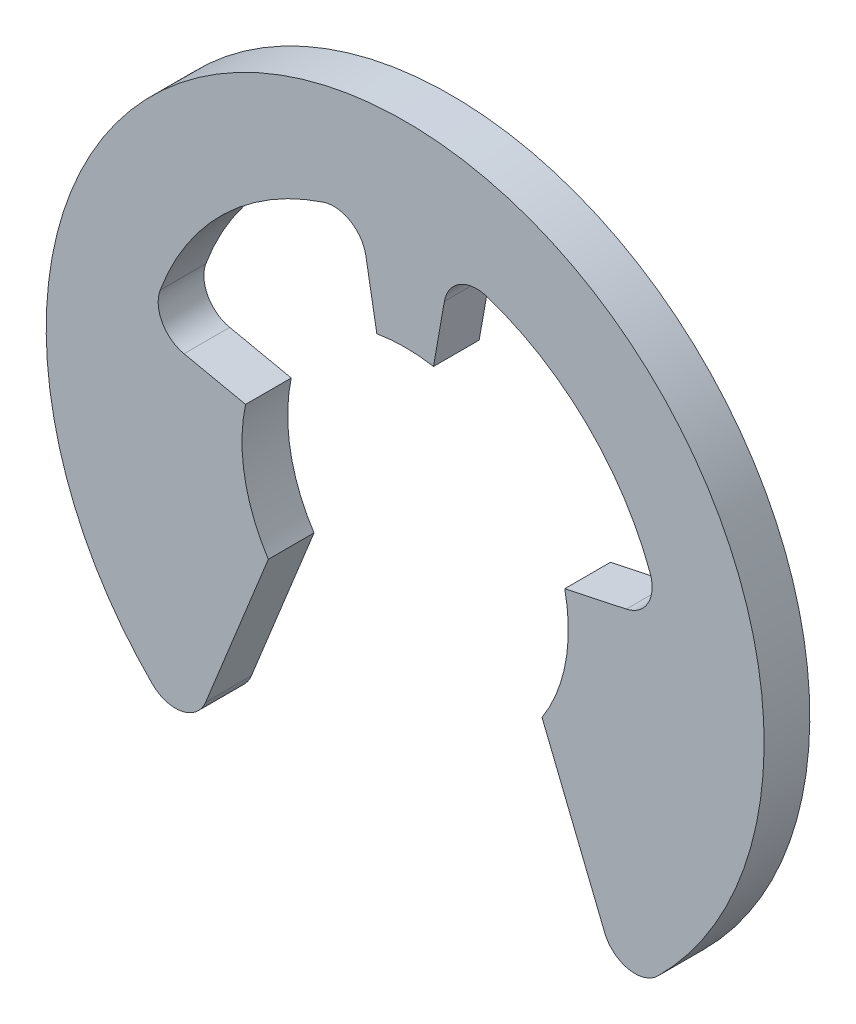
ISO-10303-21;
HEADER;
FILE_DESCRIPTION(('STEP AP214'),'2;1');
FILE_NAME('part.step','',(''),(''),'','','');
FILE_SCHEMA(('AUTOMOTIVE_DESIGN { 1 0 10303 214 1 1 1 1 }'));
ENDSEC;
DATA;
#1=APPLICATION_CONTEXT('core data for automotive mechanical design processes');
#2=APPLICATION_PROTOCOL_DEFINITION('international standard','automotive_design',2000,#1);
#3=PRODUCT_CONTEXT('',#1,'mechanical');
#4=PRODUCT('Part','Part','',(#3));
#5=PRODUCT_RELATED_PRODUCT_CATEGORY('part','',(#4));
#6=PRODUCT_DEFINITION_FORMATION('','',#4);
#7=PRODUCT_DEFINITION_CONTEXT('part definition',#1,'design');
#8=PRODUCT_DEFINITION('design','',#6,#7);
#9=PRODUCT_DEFINITION_SHAPE('','',#8);
#10=(LENGTH_UNIT() NAMED_UNIT(*) SI_UNIT(.MILLI.,.METRE.));
#11=(NAMED_UNIT(*) PLANE_ANGLE_UNIT() SI_UNIT($,.RADIAN.));
#12=(NAMED_UNIT(*) SI_UNIT($,.STERADIAN.) SOLID_ANGLE_UNIT());
#13=UNCERTAINTY_MEASURE_WITH_UNIT(LENGTH_MEASURE(1.E-05),#10,'distance_accuracy_value','');
#14=(GEOMETRIC_REPRESENTATION_CONTEXT(3) GLOBAL_UNCERTAINTY_ASSIGNED_CONTEXT((#13)) GLOBAL_UNIT_ASSIGNED_CONTEXT((#10,
#11,#12)) REPRESENTATION_CONTEXT('',''));
#15=CARTESIAN_POINT('',(0.,0.,0.));
#16=DIRECTION('',(0.,0.,1.));
#17=DIRECTION('',(1.,0.,0.));
#18=AXIS2_PLACEMENT_3D('',#15,#16,#17);
#19=CARTESIAN_POINT('',(0.,0.824703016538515,0.7));
#20=DIRECTION('',(0.,0.,1.));
#21=DIRECTION('',(1.,0.,0.));
#22=AXIS2_PLACEMENT_3D('',#19,#20,#21);
#23=PLANE('',#22);
#24=DIRECTION('',(-0.978147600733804,-0.207911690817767,0.));
#25=VECTOR('',#24,1.);
#26=CARTESIAN_POINT('',(2.44536900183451,0.519779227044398,0.7));
#27=LINE('',#26,#25);
#28=CARTESIAN_POINT('',(2.44536900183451,0.519779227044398,0.7));
#29=VERTEX_POINT('',#28);
#30=CARTESIAN_POINT('',(3.38840268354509,0.720227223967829,0.7));
#31=VERTEX_POINT('',#30);
#32=EDGE_CURVE('E168',#29,#31,#27,.F.);
#33=ORIENTED_EDGE('',*,*,#32,.F.);
#34=CARTESIAN_POINT('',(0.,0.,0.7));
#35=DIRECTION('',(0.,0.,1.));
#36=DIRECTION('',(1.,0.,0.));
#37=AXIS2_PLACEMENT_3D('',#34,#35,#36);
#38=CIRCLE('',#37,2.5);
#39=CARTESIAN_POINT('',(2.09667641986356,-1.36159758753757,0.7));
#40=VERTEX_POINT('',#39);
#41=EDGE_CURVE('E165',#29,#40,#38,.F.);
#42=ORIENTED_EDGE('',*,*,#41,.T.);
#43=DIRECTION('',(0.374606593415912,-0.927183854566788,0.));
#44=VECTOR('',#43,1.);
#45=CARTESIAN_POINT('',(3.05677916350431,-3.73793526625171,0.7));
#46=LINE('',#45,#44);
#47=CARTESIAN_POINT('',(3.05677916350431,-3.73793526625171,0.7));
#48=VERTEX_POINT('',#47);
#49=EDGE_CURVE('E144',#48,#40,#46,.F.);
#50=ORIENTED_EDGE('',*,*,#49,.F.);
#51=CARTESIAN_POINT('',(3.52037109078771,-3.55063196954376,0.7));
#52=DIRECTION('',(0.,0.,1.));
#53=DIRECTION('',(1.,0.,0.));
#54=AXIS2_PLACEMENT_3D('',#51,#52,#53);
#55=CIRCLE('',#54,0.5);
#56=CARTESIAN_POINT('',(3.87240819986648,-3.90569516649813,0.7));
#57=VERTEX_POINT('',#56);
#58=EDGE_CURVE('E19',#48,#57,#55,.T.);
#59=ORIENTED_EDGE('',*,*,#58,.T.);
#60=CARTESIAN_POINT('',(0.,0.,0.7));
#61=DIRECTION('',(0.,0.,1.));
#62=DIRECTION('',(1.,0.,0.));
#63=AXIS2_PLACEMENT_3D('',#60,#61,#62);
#64=CIRCLE('',#63,5.5);
#65=CARTESIAN_POINT('',(-3.87240819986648,-3.90569516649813,0.7));
#66=VERTEX_POINT('',#65);
#67=EDGE_CURVE('E141',#66,#57,#64,.F.);
#68=ORIENTED_EDGE('',*,*,#67,.F.);
#69=CARTESIAN_POINT('',(-3.52037109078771,-3.55063196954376,0.7));
#70=DIRECTION('',(0.,0.,1.));
#71=DIRECTION('',(1.,0.,0.));
#72=AXIS2_PLACEMENT_3D('',#69,#70,#71);
#73=CIRCLE('',#72,0.5);
#74=CARTESIAN_POINT('',(-3.05677916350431,-3.73793526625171,0.7));
#75=VERTEX_POINT('',#74);
#76=EDGE_CURVE('E151',#75,#66,#73,.F.);
#77=ORIENTED_EDGE('',*,*,#76,.F.);
#78=DIRECTION('',(0.374606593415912,0.927183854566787,0.));
#79=VECTOR('',#78,1.);
#80=CARTESIAN_POINT('',(-2.09667641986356,-1.36159758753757,0.7));
#81=LINE('',#80,#79);
#82=CARTESIAN_POINT('',(-2.09667641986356,-1.36159758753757,0.7));
#83=VERTEX_POINT('',#82);
#84=EDGE_CURVE('E212',#83,#75,#81,.F.);
#85=ORIENTED_EDGE('',*,*,#84,.F.);
#86=CARTESIAN_POINT('',(0.,0.,0.7));
#87=DIRECTION('',(0.,0.,1.));
#88=DIRECTION('',(1.,0.,0.));
#89=AXIS2_PLACEMENT_3D('',#86,#87,#88);
#90=CIRCLE('',#89,2.5);
#91=CARTESIAN_POINT('',(-2.44536900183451,0.519779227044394,0.7));
#92=VERTEX_POINT('',#91);
#93=EDGE_CURVE('E209',#83,#92,#90,.F.);
#94=ORIENTED_EDGE('',*,*,#93,.T.);
#95=DIRECTION('',(-0.978147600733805,0.207911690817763,0.));
#96=VECTOR('',#95,1.);
#97=CARTESIAN_POINT('',(-3.38840268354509,0.720227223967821,0.7));
#98=LINE('',#97,#96);
#99=CARTESIAN_POINT('',(-3.3884026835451,0.720227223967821,0.7));
#100=VERTEX_POINT('',#99);
#101=EDGE_CURVE('E205',#100,#92,#98,.F.);
#102=ORIENTED_EDGE('',*,*,#101,.F.);
#103=CARTESIAN_POINT('',(-3.28444683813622,1.20930102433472,0.7));
#104=DIRECTION('',(0.,0.,1.));
#105=DIRECTION('',(1.,0.,0.));
#106=AXIS2_PLACEMENT_3D('',#103,#104,#105);
#107=CIRCLE('',#106,0.5);
#108=CARTESIAN_POINT('',(-3.75365352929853,1.3820583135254,0.7));
#109=VERTEX_POINT('',#108);
#110=EDGE_CURVE('E199',#100,#109,#107,.F.);
#111=ORIENTED_EDGE('',*,*,#110,.T.);
#112=CARTESIAN_POINT('',(0.,0.,0.7));
#113=DIRECTION('',(0.,0.,1.));
#114=DIRECTION('',(1.,0.,0.));
#115=AXIS2_PLACEMENT_3D('',#112,#113,#114);
#116=CIRCLE('',#115,4.);
#117=CARTESIAN_POINT('',(-1.25021578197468,3.79960004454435,0.7));
#118=VERTEX_POINT('',#117);
#119=EDGE_CURVE('E195',#109,#118,#116,.F.);
#120=ORIENTED_EDGE('',*,*,#119,.T.);
#121=CARTESIAN_POINT('',(-1.09393880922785,3.32465003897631,0.7));
#122=DIRECTION('',(0.,0.,1.));
#123=DIRECTION('',(1.,0.,0.));
#124=AXIS2_PLACEMENT_3D('',#121,#122,#123);
#125=CIRCLE('',#124,0.5);
#126=CARTESIAN_POINT('',(-0.601534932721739,3.41147412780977,0.7));
#127=VERTEX_POINT('',#126);
#128=EDGE_CURVE('E194',#118,#127,#125,.F.);
#129=ORIENTED_EDGE('',*,*,#128,.T.);
#130=DIRECTION('',(0.173648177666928,-0.984807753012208,0.));
#131=VECTOR('',#130,1.);
#132=CARTESIAN_POINT('',(-0.434120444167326,2.46201938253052,0.7));
#133=LINE('',#132,#131);
#134=CARTESIAN_POINT('',(-0.434120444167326,2.46201938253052,0.7));
#135=VERTEX_POINT('',#134);
#136=EDGE_CURVE('E190',#135,#127,#133,.F.);
#137=ORIENTED_EDGE('',*,*,#136,.F.);
#138=CARTESIAN_POINT('',(0.,0.,0.7));
#139=DIRECTION('',(0.,0.,1.));
#140=DIRECTION('',(1.,0.,0.));
#141=AXIS2_PLACEMENT_3D('',#138,#139,#140);
#142=CIRCLE('',#141,2.5);
#143=CARTESIAN_POINT('',(0.434120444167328,2.46201938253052,0.7));
#144=VERTEX_POINT('',#143);
#145=EDGE_CURVE('E187',#135,#144,#142,.F.);
#146=ORIENTED_EDGE('',*,*,#145,.T.);
#147=DIRECTION('',(0.173648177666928,0.984807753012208,0.));
#148=VECTOR('',#147,1.);
#149=CARTESIAN_POINT('',(0.601534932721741,3.41147412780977,0.7));
#150=LINE('',#149,#148);
#151=CARTESIAN_POINT('',(0.601534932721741,3.41147412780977,0.7));
#152=VERTEX_POINT('',#151);
#153=EDGE_CURVE('E183',#152,#144,#150,.F.);
#154=ORIENTED_EDGE('',*,*,#153,.F.);
#155=CARTESIAN_POINT('',(1.09393880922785,3.32465003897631,0.7));
#156=DIRECTION('',(0.,0.,1.));
#157=DIRECTION('',(1.,0.,0.));
#158=AXIS2_PLACEMENT_3D('',#155,#156,#157);
#159=CIRCLE('',#158,0.5);
#160=CARTESIAN_POINT('',(1.25021578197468,3.79960004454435,0.7));
#161=VERTEX_POINT('',#160);
#162=EDGE_CURVE('E177',#152,#161,#159,.F.);
#163=ORIENTED_EDGE('',*,*,#162,.T.);
#164=CARTESIAN_POINT('',(0.,0.,0.7));
#165=DIRECTION('',(0.,0.,1.));
#166=DIRECTION('',(1.,0.,0.));
#167=AXIS2_PLACEMENT_3D('',#164,#165,#166);
#168=CIRCLE('',#167,4.);
#169=CARTESIAN_POINT('',(3.75365352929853,1.3820583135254,0.7));
#170=VERTEX_POINT('',#169);
#171=EDGE_CURVE('E173',#161,#170,#168,.F.);
#172=ORIENTED_EDGE('',*,*,#171,.T.);
#173=CARTESIAN_POINT('',(3.28444683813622,1.20930102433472,0.7));
#174=DIRECTION('',(0.,0.,1.));
#175=DIRECTION('',(1.,0.,0.));
#176=AXIS2_PLACEMENT_3D('',#173,#174,#175);
#177=CIRCLE('',#176,0.5);
#178=EDGE_CURVE('E172',#170,#31,#177,.F.);
#179=ORIENTED_EDGE('',*,*,#178,.T.);
#180=EDGE_LOOP('',(#33,#42,#50,#59,#68,#77,#85,#94,#102,#111,#120,#129,#137,#146,#154,#163,#172,#179));
#181=FACE_BOUND('',#180,.T.);
#182=ADVANCED_FACE('F15',(#181),#23,.T.);
#183=CARTESIAN_POINT('',(0.,0.,0.));
#184=DIRECTION('',(0.,0.,1.));
#185=DIRECTION('',(1.,0.,0.));
#186=AXIS2_PLACEMENT_3D('',#183,#184,#185);
#187=CYLINDRICAL_SURFACE('',#186,5.5);
#188=CARTESIAN_POINT('',(0.,0.,0.));
#189=DIRECTION('',(0.,0.,1.));
#190=DIRECTION('',(1.,0.,0.));
#191=AXIS2_PLACEMENT_3D('',#188,#189,#190);
#192=CIRCLE('',#191,5.5);
#193=CARTESIAN_POINT('',(3.87240819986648,-3.90569516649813,0.));
#194=VERTEX_POINT('',#193);
#195=CARTESIAN_POINT('',(-3.87240819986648,-3.90569516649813,0.));
#196=VERTEX_POINT('',#195);
#197=EDGE_CURVE('E153',#194,#196,#192,.T.);
#198=ORIENTED_EDGE('',*,*,#197,.T.);
#199=DIRECTION('',(0.,0.,1.));
#200=VECTOR('',#199,1.);
#201=CARTESIAN_POINT('',(-3.87240819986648,-3.90569516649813,0.));
#202=LINE('',#201,#200);
#203=EDGE_CURVE('E150',#66,#196,#202,.F.);
#204=ORIENTED_EDGE('',*,*,#203,.F.);
#205=ORIENTED_EDGE('',*,*,#67,.T.);
#206=DIRECTION('',(0.,0.,1.));
#207=VECTOR('',#206,1.);
#208=CARTESIAN_POINT('',(3.87240819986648,-3.90569516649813,0.));
#209=LINE('',#208,#207);
#210=EDGE_CURVE('E149',#194,#57,#209,.T.);
#211=ORIENTED_EDGE('',*,*,#210,.F.);
#212=EDGE_LOOP('',(#198,#204,#205,#211));
#213=FACE_BOUND('',#212,.T.);
#214=ADVANCED_FACE('F148',(#213),#187,.T.);
#215=CARTESIAN_POINT('',(-3.52037109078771,-3.55063196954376,0.));
#216=DIRECTION('',(0.,0.,1.));
#217=DIRECTION('',(1.,0.,0.));
#218=AXIS2_PLACEMENT_3D('',#215,#216,#217);
#219=CYLINDRICAL_SURFACE('',#218,0.5);
#220=CARTESIAN_POINT('',(-3.52037109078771,-3.55063196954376,0.));
#221=DIRECTION('',(0.,0.,1.));
#222=DIRECTION('',(1.,0.,0.));
#223=AXIS2_PLACEMENT_3D('',#220,#221,#222);
#224=CIRCLE('',#223,0.5);
#225=CARTESIAN_POINT('',(-3.05677916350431,-3.73793526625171,0.));
#226=VERTEX_POINT('',#225);
#227=EDGE_CURVE('E155',#196,#226,#224,.T.);
#228=ORIENTED_EDGE('',*,*,#227,.T.);
#229=DIRECTION('',(0.,0.,1.));
#230=VECTOR('',#229,1.);
#231=CARTESIAN_POINT('',(-3.05677916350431,-3.73793526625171,0.));
#232=LINE('',#231,#230);
#233=EDGE_CURVE('E210',#75,#226,#232,.F.);
#234=ORIENTED_EDGE('',*,*,#233,.F.);
#235=ORIENTED_EDGE('',*,*,#76,.T.);
#236=ORIENTED_EDGE('',*,*,#203,.T.);
#237=EDGE_LOOP('',(#228,#234,#235,#236));
#238=FACE_BOUND('',#237,.T.);
#239=ADVANCED_FACE('F269',(#238),#219,.T.);
#240=CARTESIAN_POINT('',(-2.09667641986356,-1.36159758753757,0.));
#241=DIRECTION('',(0.927183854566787,-0.374606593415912,0.));
#242=DIRECTION('',(0.374606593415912,0.927183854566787,0.));
#243=AXIS2_PLACEMENT_3D('',#240,#241,#242);
#244=PLANE('',#243);
#245=DIRECTION('',(0.374606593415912,0.927183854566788,0.));
#246=VECTOR('',#245,1.);
#247=CARTESIAN_POINT('',(-3.05677916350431,-3.73793526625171,0.));
#248=LINE('',#247,#246);
#249=CARTESIAN_POINT('',(-2.09667641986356,-1.36159758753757,0.));
#250=VERTEX_POINT('',#249);
#251=EDGE_CURVE('E251',#226,#250,#248,.T.);
#252=ORIENTED_EDGE('',*,*,#251,.T.);
#253=DIRECTION('',(0.,0.,1.));
#254=VECTOR('',#253,1.);
#255=CARTESIAN_POINT('',(-2.09667641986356,-1.36159758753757,0.));
#256=LINE('',#255,#254);
#257=EDGE_CURVE('E206',#250,#83,#256,.T.);
#258=ORIENTED_EDGE('',*,*,#257,.T.);
#259=ORIENTED_EDGE('',*,*,#84,.T.);
#260=ORIENTED_EDGE('',*,*,#233,.T.);
#261=EDGE_LOOP('',(#252,#258,#259,#260));
#262=FACE_BOUND('',#261,.T.);
#263=ADVANCED_FACE('F278',(#262),#244,.T.);
#264=CARTESIAN_POINT('',(0.,0.,0.));
#265=DIRECTION('',(0.,0.,1.));
#266=DIRECTION('',(1.,0.,0.));
#267=AXIS2_PLACEMENT_3D('',#264,#265,#266);
#268=CYLINDRICAL_SURFACE('',#267,2.5);
#269=ORIENTED_EDGE('',*,*,#257,.F.);
#270=CARTESIAN_POINT('',(0.,0.,0.));
#271=DIRECTION('',(0.,0.,1.));
#272=DIRECTION('',(1.,0.,0.));
#273=AXIS2_PLACEMENT_3D('',#270,#271,#272);
#274=CIRCLE('',#273,2.5);
#275=CARTESIAN_POINT('',(-2.44536900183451,0.519779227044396,0.));
#276=VERTEX_POINT('',#275);
#277=EDGE_CURVE('E248',#250,#276,#274,.F.);
#278=ORIENTED_EDGE('',*,*,#277,.T.);
#279=DIRECTION('',(0.,0.,1.));
#280=VECTOR('',#279,1.);
#281=CARTESIAN_POINT('',(-2.44536900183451,0.519779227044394,0.));
#282=LINE('',#281,#280);
#283=EDGE_CURVE('E203',#92,#276,#282,.F.);
#284=ORIENTED_EDGE('',*,*,#283,.F.);
#285=ORIENTED_EDGE('',*,*,#93,.F.);
#286=EDGE_LOOP('',(#269,#278,#284,#285));
#287=FACE_BOUND('',#286,.T.);
#288=ADVANCED_FACE('F275',(#287),#268,.F.);
#289=CARTESIAN_POINT('',(-3.38840268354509,0.720227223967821,0.));
#290=DIRECTION('',(0.207911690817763,0.978147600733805,0.));
#291=DIRECTION('',(-0.978147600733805,0.207911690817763,0.));
#292=AXIS2_PLACEMENT_3D('',#289,#290,#291);
#293=PLANE('',#292);
#294=DIRECTION('',(-0.978147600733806,0.207911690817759,0.));
#295=VECTOR('',#294,1.);
#296=CARTESIAN_POINT('',(-2.44536900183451,0.519779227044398,0.));
#297=LINE('',#296,#295);
#298=CARTESIAN_POINT('',(-3.38840268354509,0.720227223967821,0.));
#299=VERTEX_POINT('',#298);
#300=EDGE_CURVE('E247',#276,#299,#297,.T.);
#301=ORIENTED_EDGE('',*,*,#300,.T.);
#302=DIRECTION('',(0.,0.,1.));
#303=VECTOR('',#302,1.);
#304=CARTESIAN_POINT('',(-3.38840268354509,0.720227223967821,0.));
#305=LINE('',#304,#303);
#306=EDGE_CURVE('E200',#299,#100,#305,.T.);
#307=ORIENTED_EDGE('',*,*,#306,.T.);
#308=ORIENTED_EDGE('',*,*,#101,.T.);
#309=ORIENTED_EDGE('',*,*,#283,.T.);
#310=EDGE_LOOP('',(#301,#307,#308,#309));
#311=FACE_BOUND('',#310,.T.);
#312=ADVANCED_FACE('F341',(#311),#293,.T.);
#313=CARTESIAN_POINT('',(-3.28444683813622,1.20930102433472,0.));
#314=DIRECTION('',(0.,0.,1.));
#315=DIRECTION('',(1.,0.,0.));
#316=AXIS2_PLACEMENT_3D('',#313,#314,#315);
#317=CYLINDRICAL_SURFACE('',#316,0.5);
#318=ORIENTED_EDGE('',*,*,#306,.F.);
#319=CARTESIAN_POINT('',(-3.28444683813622,1.20930102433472,0.));
#320=DIRECTION('',(0.,0.,1.));
#321=DIRECTION('',(1.,0.,0.));
#322=AXIS2_PLACEMENT_3D('',#319,#320,#321);
#323=CIRCLE('',#322,0.5);
#324=CARTESIAN_POINT('',(-3.75365352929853,1.3820583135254,0.));
#325=VERTEX_POINT('',#324);
#326=EDGE_CURVE('E244',#299,#325,#323,.F.);
#327=ORIENTED_EDGE('',*,*,#326,.T.);
#328=DIRECTION('',(0.,0.,1.));
#329=VECTOR('',#328,1.);
#330=CARTESIAN_POINT('',(-3.75365352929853,1.3820583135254,0.));
#331=LINE('',#330,#329);
#332=EDGE_CURVE('E196',#325,#109,#331,.T.);
#333=ORIENTED_EDGE('',*,*,#332,.T.);
#334=ORIENTED_EDGE('',*,*,#110,.F.);
#335=EDGE_LOOP('',(#318,#327,#333,#334));
#336=FACE_BOUND('',#335,.T.);
#337=ADVANCED_FACE('F338',(#336),#317,.F.);
#338=CARTESIAN_POINT('',(0.,0.,0.));
#339=DIRECTION('',(0.,0.,1.));
#340=DIRECTION('',(1.,0.,0.));
#341=AXIS2_PLACEMENT_3D('',#338,#339,#340);
#342=CYLINDRICAL_SURFACE('',#341,4.);
#343=ORIENTED_EDGE('',*,*,#332,.F.);
#344=CARTESIAN_POINT('',(0.,0.,0.));
#345=DIRECTION('',(0.,0.,1.));
#346=DIRECTION('',(1.,0.,0.));
#347=AXIS2_PLACEMENT_3D('',#344,#345,#346);
#348=CIRCLE('',#347,4.);
#349=CARTESIAN_POINT('',(-1.25021578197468,3.79960004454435,0.));
#350=VERTEX_POINT('',#349);
#351=EDGE_CURVE('E241',#325,#350,#348,.F.);
#352=ORIENTED_EDGE('',*,*,#351,.T.);
#353=DIRECTION('',(0.,0.,1.));
#354=VECTOR('',#353,1.);
#355=CARTESIAN_POINT('',(-1.25021578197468,3.79960004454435,0.));
#356=LINE('',#355,#354);
#357=EDGE_CURVE('E191',#350,#118,#356,.T.);
#358=ORIENTED_EDGE('',*,*,#357,.T.);
#359=ORIENTED_EDGE('',*,*,#119,.F.);
#360=EDGE_LOOP('',(#343,#352,#358,#359));
#361=FACE_BOUND('',#360,.T.);
#362=ADVANCED_FACE('F334',(#361),#342,.F.);
#363=CARTESIAN_POINT('',(-1.09393880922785,3.32465003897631,0.));
#364=DIRECTION('',(0.,0.,1.));
#365=DIRECTION('',(1.,0.,0.));
#366=AXIS2_PLACEMENT_3D('',#363,#364,#365);
#367=CYLINDRICAL_SURFACE('',#366,0.5);
#368=ORIENTED_EDGE('',*,*,#357,.F.);
#369=CARTESIAN_POINT('',(-1.09393880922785,3.32465003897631,0.));
#370=DIRECTION('',(0.,0.,1.));
#371=DIRECTION('',(1.,0.,0.));
#372=AXIS2_PLACEMENT_3D('',#369,#370,#371);
#373=CIRCLE('',#372,0.5);
#374=CARTESIAN_POINT('',(-0.601534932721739,3.41147412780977,0.));
#375=VERTEX_POINT('',#374);
#376=EDGE_CURVE('E238',#350,#375,#373,.F.);
#377=ORIENTED_EDGE('',*,*,#376,.T.);
#378=DIRECTION('',(0.,0.,1.));
#379=VECTOR('',#378,1.);
#380=CARTESIAN_POINT('',(-0.601534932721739,3.41147412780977,0.));
#381=LINE('',#380,#379);
#382=EDGE_CURVE('E188',#127,#375,#381,.F.);
#383=ORIENTED_EDGE('',*,*,#382,.F.);
#384=ORIENTED_EDGE('',*,*,#128,.F.);
#385=EDGE_LOOP('',(#368,#377,#383,#384));
#386=FACE_BOUND('',#385,.T.);
#387=ADVANCED_FACE('F330',(#386),#367,.F.);
#388=CARTESIAN_POINT('',(-0.434120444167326,2.46201938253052,0.));
#389=DIRECTION('',(-0.984807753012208,-0.173648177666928,0.));
#390=DIRECTION('',(0.173648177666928,-0.984807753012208,0.));
#391=AXIS2_PLACEMENT_3D('',#388,#389,#390);
#392=PLANE('',#391);
#393=DIRECTION('',(0.173648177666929,-0.984807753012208,0.));
#394=VECTOR('',#393,1.);
#395=CARTESIAN_POINT('',(-0.60153493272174,3.41147412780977,0.));
#396=LINE('',#395,#394);
#397=CARTESIAN_POINT('',(-0.434120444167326,2.46201938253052,0.));
#398=VERTEX_POINT('',#397);
#399=EDGE_CURVE('E237',#375,#398,#396,.T.);
#400=ORIENTED_EDGE('',*,*,#399,.T.);
#401=DIRECTION('',(0.,0.,1.));
#402=VECTOR('',#401,1.);
#403=CARTESIAN_POINT('',(-0.434120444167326,2.46201938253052,0.));
#404=LINE('',#403,#402);
#405=EDGE_CURVE('E184',#398,#135,#404,.T.);
#406=ORIENTED_EDGE('',*,*,#405,.T.);
#407=ORIENTED_EDGE('',*,*,#136,.T.);
#408=ORIENTED_EDGE('',*,*,#382,.T.);
#409=EDGE_LOOP('',(#400,#406,#407,#408));
#410=FACE_BOUND('',#409,.T.);
#411=ADVANCED_FACE('F325',(#410),#392,.T.);
#412=CARTESIAN_POINT('',(0.,0.,0.));
#413=DIRECTION('',(0.,0.,1.));
#414=DIRECTION('',(1.,0.,0.));
#415=AXIS2_PLACEMENT_3D('',#412,#413,#414);
#416=CYLINDRICAL_SURFACE('',#415,2.5);
#417=ORIENTED_EDGE('',*,*,#405,.F.);
#418=CARTESIAN_POINT('',(0.,0.,0.));
#419=DIRECTION('',(0.,0.,1.));
#420=DIRECTION('',(1.,0.,0.));
#421=AXIS2_PLACEMENT_3D('',#418,#419,#420);
#422=CIRCLE('',#421,2.5);
#423=CARTESIAN_POINT('',(0.434120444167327,2.46201938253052,0.));
#424=VERTEX_POINT('',#423);
#425=EDGE_CURVE('E234',#398,#424,#422,.F.);
#426=ORIENTED_EDGE('',*,*,#425,.T.);
#427=DIRECTION('',(0.,0.,1.));
#428=VECTOR('',#427,1.);
#429=CARTESIAN_POINT('',(0.434120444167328,2.46201938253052,0.));
#430=LINE('',#429,#428);
#431=EDGE_CURVE('E181',#144,#424,#430,.F.);
#432=ORIENTED_EDGE('',*,*,#431,.F.);
#433=ORIENTED_EDGE('',*,*,#145,.F.);
#434=EDGE_LOOP('',(#417,#426,#432,#433));
#435=FACE_BOUND('',#434,.T.);
#436=ADVANCED_FACE('F322',(#435),#416,.F.);
#437=CARTESIAN_POINT('',(0.601534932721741,3.41147412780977,0.));
#438=DIRECTION('',(0.984807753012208,-0.173648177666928,0.));
#439=DIRECTION('',(0.173648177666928,0.984807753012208,0.));
#440=AXIS2_PLACEMENT_3D('',#437,#438,#439);
#441=PLANE('',#440);
#442=DIRECTION('',(0.17364817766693,0.984807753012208,0.));
#443=VECTOR('',#442,1.);
#444=CARTESIAN_POINT('',(0.434120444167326,2.46201938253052,0.));
#445=LINE('',#444,#443);
#446=CARTESIAN_POINT('',(0.601534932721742,3.41147412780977,0.));
#447=VERTEX_POINT('',#446);
#448=EDGE_CURVE('E233',#424,#447,#445,.T.);
#449=ORIENTED_EDGE('',*,*,#448,.T.);
#450=DIRECTION('',(0.,0.,1.));
#451=VECTOR('',#450,1.);
#452=CARTESIAN_POINT('',(0.601534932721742,3.41147412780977,0.));
#453=LINE('',#452,#451);
#454=EDGE_CURVE('E178',#447,#152,#453,.T.);
#455=ORIENTED_EDGE('',*,*,#454,.T.);
#456=ORIENTED_EDGE('',*,*,#153,.T.);
#457=ORIENTED_EDGE('',*,*,#431,.T.);
#458=EDGE_LOOP('',(#449,#455,#456,#457));
#459=FACE_BOUND('',#458,.T.);
#460=ADVANCED_FACE('F317',(#459),#441,.T.);
#461=CARTESIAN_POINT('',(1.09393880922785,3.32465003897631,0.));
#462=DIRECTION('',(0.,0.,1.));
#463=DIRECTION('',(1.,0.,0.));
#464=AXIS2_PLACEMENT_3D('',#461,#462,#463);
#465=CYLINDRICAL_SURFACE('',#464,0.5);
#466=ORIENTED_EDGE('',*,*,#454,.F.);
#467=CARTESIAN_POINT('',(1.09393880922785,3.32465003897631,0.));
#468=DIRECTION('',(0.,0.,1.));
#469=DIRECTION('',(1.,0.,0.));
#470=AXIS2_PLACEMENT_3D('',#467,#468,#469);
#471=CIRCLE('',#470,0.5);
#472=CARTESIAN_POINT('',(1.25021578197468,3.79960004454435,0.));
#473=VERTEX_POINT('',#472);
#474=EDGE_CURVE('E230',#447,#473,#471,.F.);
#475=ORIENTED_EDGE('',*,*,#474,.T.);
#476=DIRECTION('',(0.,0.,1.));
#477=VECTOR('',#476,1.);
#478=CARTESIAN_POINT('',(1.25021578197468,3.79960004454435,0.));
#479=LINE('',#478,#477);
#480=EDGE_CURVE('E174',#473,#161,#479,.T.);
#481=ORIENTED_EDGE('',*,*,#480,.T.);
#482=ORIENTED_EDGE('',*,*,#162,.F.);
#483=EDGE_LOOP('',(#466,#475,#481,#482));
#484=FACE_BOUND('',#483,.T.);
#485=ADVANCED_FACE('F314',(#484),#465,.F.);
#486=CARTESIAN_POINT('',(0.,0.,0.));
#487=DIRECTION('',(0.,0.,1.));
#488=DIRECTION('',(1.,0.,0.));
#489=AXIS2_PLACEMENT_3D('',#486,#487,#488);
#490=CYLINDRICAL_SURFACE('',#489,4.);
#491=ORIENTED_EDGE('',*,*,#480,.F.);
#492=CARTESIAN_POINT('',(0.,0.,0.));
#493=DIRECTION('',(0.,0.,1.));
#494=DIRECTION('',(1.,0.,0.));
#495=AXIS2_PLACEMENT_3D('',#492,#493,#494);
#496=CIRCLE('',#495,4.);
#497=CARTESIAN_POINT('',(3.75365352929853,1.3820583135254,0.));
#498=VERTEX_POINT('',#497);
#499=EDGE_CURVE('E227',#473,#498,#496,.F.);
#500=ORIENTED_EDGE('',*,*,#499,.T.);
#501=DIRECTION('',(0.,0.,1.));
#502=VECTOR('',#501,1.);
#503=CARTESIAN_POINT('',(3.75365352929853,1.3820583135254,0.));
#504=LINE('',#503,#502);
#505=EDGE_CURVE('E169',#498,#170,#504,.T.);
#506=ORIENTED_EDGE('',*,*,#505,.T.);
#507=ORIENTED_EDGE('',*,*,#171,.F.);
#508=EDGE_LOOP('',(#491,#500,#506,#507));
#509=FACE_BOUND('',#508,.T.);
#510=ADVANCED_FACE('F310',(#509),#490,.F.);
#511=CARTESIAN_POINT('',(3.28444683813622,1.20930102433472,0.));
#512=DIRECTION('',(0.,0.,1.));
#513=DIRECTION('',(1.,0.,0.));
#514=AXIS2_PLACEMENT_3D('',#511,#512,#513);
#515=CYLINDRICAL_SURFACE('',#514,0.5);
#516=ORIENTED_EDGE('',*,*,#505,.F.);
#517=CARTESIAN_POINT('',(3.28444683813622,1.20930102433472,0.));
#518=DIRECTION('',(0.,0.,1.));
#519=DIRECTION('',(1.,0.,0.));
#520=AXIS2_PLACEMENT_3D('',#517,#518,#519);
#521=CIRCLE('',#520,0.5);
#522=CARTESIAN_POINT('',(3.38840268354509,0.720227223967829,0.));
#523=VERTEX_POINT('',#522);
#524=EDGE_CURVE('E224',#498,#523,#521,.F.);
#525=ORIENTED_EDGE('',*,*,#524,.T.);
#526=DIRECTION('',(0.,0.,1.));
#527=VECTOR('',#526,1.);
#528=CARTESIAN_POINT('',(3.38840268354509,0.720227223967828,0.));
#529=LINE('',#528,#527);
#530=EDGE_CURVE('E166',#31,#523,#529,.F.);
#531=ORIENTED_EDGE('',*,*,#530,.F.);
#532=ORIENTED_EDGE('',*,*,#178,.F.);
#533=EDGE_LOOP('',(#516,#525,#531,#532));
#534=FACE_BOUND('',#533,.T.);
#535=ADVANCED_FACE('F306',(#534),#515,.F.);
#536=CARTESIAN_POINT('',(2.44536900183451,0.519779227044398,0.));
#537=DIRECTION('',(-0.207911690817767,0.978147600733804,0.));
#538=DIRECTION('',(-0.978147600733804,-0.207911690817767,0.));
#539=AXIS2_PLACEMENT_3D('',#536,#537,#538);
#540=PLANE('',#539);
#541=DIRECTION('',(-0.978147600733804,-0.207911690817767,0.));
#542=VECTOR('',#541,1.);
#543=CARTESIAN_POINT('',(3.38840268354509,0.720227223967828,0.));
#544=LINE('',#543,#542);
#545=CARTESIAN_POINT('',(2.44536900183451,0.519779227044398,0.));
#546=VERTEX_POINT('',#545);
#547=EDGE_CURVE('E223',#523,#546,#544,.T.);
#548=ORIENTED_EDGE('',*,*,#547,.T.);
#549=DIRECTION('',(0.,0.,1.));
#550=VECTOR('',#549,1.);
#551=CARTESIAN_POINT('',(2.44536900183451,0.519779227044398,0.));
#552=LINE('',#551,#550);
#553=EDGE_CURVE('E162',#546,#29,#552,.T.);
#554=ORIENTED_EDGE('',*,*,#553,.T.);
#555=ORIENTED_EDGE('',*,*,#32,.T.);
#556=ORIENTED_EDGE('',*,*,#530,.T.);
#557=EDGE_LOOP('',(#548,#554,#555,#556));
#558=FACE_BOUND('',#557,.T.);
#559=ADVANCED_FACE('F301',(#558),#540,.T.);
#560=CARTESIAN_POINT('',(0.,0.,0.));
#561=DIRECTION('',(0.,0.,1.));
#562=DIRECTION('',(1.,0.,0.));
#563=AXIS2_PLACEMENT_3D('',#560,#561,#562);
#564=CYLINDRICAL_SURFACE('',#563,2.5);
#565=ORIENTED_EDGE('',*,*,#553,.F.);
#566=CARTESIAN_POINT('',(0.,0.,0.));
#567=DIRECTION('',(0.,0.,1.));
#568=DIRECTION('',(1.,0.,0.));
#569=AXIS2_PLACEMENT_3D('',#566,#567,#568);
#570=CIRCLE('',#569,2.5);
#571=CARTESIAN_POINT('',(2.09667641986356,-1.36159758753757,0.));
#572=VERTEX_POINT('',#571);
#573=EDGE_CURVE('E220',#546,#572,#570,.F.);
#574=ORIENTED_EDGE('',*,*,#573,.T.);
#575=DIRECTION('',(0.,0.,1.));
#576=VECTOR('',#575,1.);
#577=CARTESIAN_POINT('',(2.09667641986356,-1.36159758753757,0.));
#578=LINE('',#577,#576);
#579=EDGE_CURVE('E157',#40,#572,#578,.F.);
#580=ORIENTED_EDGE('',*,*,#579,.F.);
#581=ORIENTED_EDGE('',*,*,#41,.F.);
#582=EDGE_LOOP('',(#565,#574,#580,#581));
#583=FACE_BOUND('',#582,.T.);
#584=ADVANCED_FACE('F298',(#583),#564,.F.);
#585=CARTESIAN_POINT('',(3.05677916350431,-3.73793526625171,0.));
#586=DIRECTION('',(-0.927183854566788,-0.374606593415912,0.));
#587=DIRECTION('',(0.374606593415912,-0.927183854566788,0.));
#588=AXIS2_PLACEMENT_3D('',#585,#586,#587);
#589=PLANE('',#588);
#590=DIRECTION('',(0.374606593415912,-0.927183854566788,0.));
#591=VECTOR('',#590,1.);
#592=CARTESIAN_POINT('',(2.09667641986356,-1.36159758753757,0.));
#593=LINE('',#592,#591);
#594=CARTESIAN_POINT('',(3.05677916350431,-3.73793526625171,0.));
#595=VERTEX_POINT('',#594);
#596=EDGE_CURVE('E25',#572,#595,#593,.T.);
#597=ORIENTED_EDGE('',*,*,#596,.T.);
#598=DIRECTION('',(0.,0.,1.));
#599=VECTOR('',#598,1.);
#600=CARTESIAN_POINT('',(3.05677916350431,-3.73793526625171,0.));
#601=LINE('',#600,#599);
#602=EDGE_CURVE('E33',#48,#595,#601,.F.);
#603=ORIENTED_EDGE('',*,*,#602,.F.);
#604=ORIENTED_EDGE('',*,*,#49,.T.);
#605=ORIENTED_EDGE('',*,*,#579,.T.);
#606=EDGE_LOOP('',(#597,#603,#604,#605));
#607=FACE_BOUND('',#606,.T.);
#608=ADVANCED_FACE('F293',(#607),#589,.T.);
#609=CARTESIAN_POINT('',(3.52037109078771,-3.55063196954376,0.));
#610=DIRECTION('',(0.,0.,1.));
#611=DIRECTION('',(1.,0.,0.));
#612=AXIS2_PLACEMENT_3D('',#609,#610,#611);
#613=CYLINDRICAL_SURFACE('',#612,0.5);
#614=CARTESIAN_POINT('',(3.52037109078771,-3.55063196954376,0.));
#615=DIRECTION('',(0.,0.,1.));
#616=DIRECTION('',(1.,0.,0.));
#617=AXIS2_PLACEMENT_3D('',#614,#615,#616);
#618=CIRCLE('',#617,0.5);
#619=EDGE_CURVE('E10',#595,#194,#618,.T.);
#620=ORIENTED_EDGE('',*,*,#619,.T.);
#621=ORIENTED_EDGE('',*,*,#210,.T.);
#622=ORIENTED_EDGE('',*,*,#58,.F.);
#623=ORIENTED_EDGE('',*,*,#602,.T.);
#624=EDGE_LOOP('',(#620,#621,#622,#623));
#625=FACE_BOUND('',#624,.T.);
#626=ADVANCED_FACE('F152',(#625),#613,.T.);
#627=CARTESIAN_POINT('',(0.,0.824703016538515,0.));
#628=DIRECTION('',(0.,0.,1.));
#629=DIRECTION('',(1.,0.,0.));
#630=AXIS2_PLACEMENT_3D('',#627,#628,#629);
#631=PLANE('',#630);
#632=ORIENTED_EDGE('',*,*,#596,.F.);
#633=ORIENTED_EDGE('',*,*,#573,.F.);
#634=ORIENTED_EDGE('',*,*,#547,.F.);
#635=ORIENTED_EDGE('',*,*,#524,.F.);
#636=ORIENTED_EDGE('',*,*,#499,.F.);
#637=ORIENTED_EDGE('',*,*,#474,.F.);
#638=ORIENTED_EDGE('',*,*,#448,.F.);
#639=ORIENTED_EDGE('',*,*,#425,.F.);
#640=ORIENTED_EDGE('',*,*,#399,.F.);
#641=ORIENTED_EDGE('',*,*,#376,.F.);
#642=ORIENTED_EDGE('',*,*,#351,.F.);
#643=ORIENTED_EDGE('',*,*,#326,.F.);
#644=ORIENTED_EDGE('',*,*,#300,.F.);
#645=ORIENTED_EDGE('',*,*,#277,.F.);
#646=ORIENTED_EDGE('',*,*,#251,.F.);
#647=ORIENTED_EDGE('',*,*,#227,.F.);
#648=ORIENTED_EDGE('',*,*,#197,.F.);
#649=ORIENTED_EDGE('',*,*,#619,.F.);
#650=EDGE_LOOP('',(#632,#633,#634,#635,#636,#637,#638,#639,#640,#641,#642,#643,#644,#645,#646,
#647,#648,#649));
#651=FACE_BOUND('',#650,.T.);
#652=ADVANCED_FACE('F17',(#651),#631,.F.);
#653=CLOSED_SHELL('',(#182,#214,#239,#263,#288,#312,#337,#362,#387,#411,#436,#460,#485,#510,
#535,#559,#584,#608,#626,#652));
#654=MANIFOLD_SOLID_BREP('B1',#653);
#655=ADVANCED_BREP_SHAPE_REPRESENTATION('',(#18,#654),#14);
#656=SHAPE_DEFINITION_REPRESENTATION(#9,#655);
ENDSEC;
END-ISO-10303-21;
